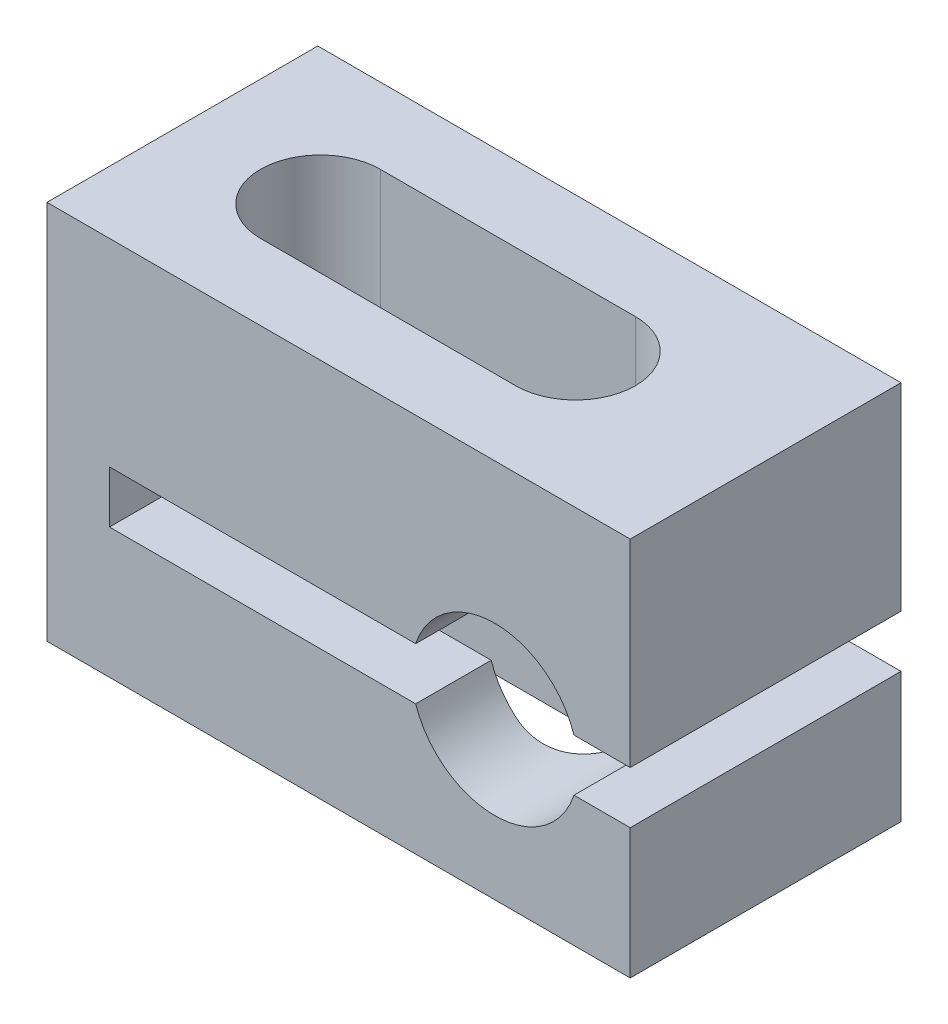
ISO-10303-21;
HEADER;
FILE_DESCRIPTION(('STEP AP214'),'2;1');
FILE_NAME('part.step','',(''),(''),'','','');
FILE_SCHEMA(('AUTOMOTIVE_DESIGN { 1 0 10303 214 1 1 1 1 }'));
ENDSEC;
DATA;
#1=APPLICATION_CONTEXT('core data for automotive mechanical design processes');
#2=APPLICATION_PROTOCOL_DEFINITION('international standard','automotive_design',2000,#1);
#3=PRODUCT_CONTEXT('',#1,'mechanical');
#4=PRODUCT('Part','Part','',(#3));
#5=PRODUCT_RELATED_PRODUCT_CATEGORY('part','',(#4));
#6=PRODUCT_DEFINITION_FORMATION('','',#4);
#7=PRODUCT_DEFINITION_CONTEXT('part definition',#1,'design');
#8=PRODUCT_DEFINITION('design','',#6,#7);
#9=PRODUCT_DEFINITION_SHAPE('','',#8);
#10=(LENGTH_UNIT() NAMED_UNIT(*) SI_UNIT(.MILLI.,.METRE.));
#11=(NAMED_UNIT(*) PLANE_ANGLE_UNIT() SI_UNIT($,.RADIAN.));
#12=(NAMED_UNIT(*) SI_UNIT($,.STERADIAN.) SOLID_ANGLE_UNIT());
#13=UNCERTAINTY_MEASURE_WITH_UNIT(LENGTH_MEASURE(1.E-05),#10,'distance_accuracy_value','');
#14=(GEOMETRIC_REPRESENTATION_CONTEXT(3) GLOBAL_UNCERTAINTY_ASSIGNED_CONTEXT((#13)) GLOBAL_UNIT_ASSIGNED_CONTEXT((#10,
#11,#12)) REPRESENTATION_CONTEXT('',''));
#15=CARTESIAN_POINT('',(0.,0.,0.));
#16=DIRECTION('',(0.,0.,1.));
#17=DIRECTION('',(1.,0.,0.));
#18=AXIS2_PLACEMENT_3D('',#15,#16,#17);
#19=CARTESIAN_POINT('',(17.6045,0.182500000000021,21.0241));
#20=DIRECTION('',(0.,0.,-1.));
#21=DIRECTION('',(-1.,0.,0.));
#22=AXIS2_PLACEMENT_3D('',#19,#20,#21);
#23=PLANE('',#22);
#24=CARTESIAN_POINT('',(18.938,-5.27850000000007,21.0241));
#25=DIRECTION('',(0.,0.,1.));
#26=DIRECTION('',(0.,-1.,0.));
#27=AXIS2_PLACEMENT_3D('',#24,#25,#26);
#28=CIRCLE('',#27,2.032);
#29=CARTESIAN_POINT('',(17.0077671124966,-4.64349999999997,21.0241));
#30=VERTEX_POINT('',#29);
#31=CARTESIAN_POINT('',(17.6045,-3.74526754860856,21.0241));
#32=VERTEX_POINT('',#31);
#33=EDGE_CURVE('E263',#30,#32,#28,.F.);
#34=ORIENTED_EDGE('',*,*,#33,.T.);
#35=DIRECTION('',(0.,-1.,0.));
#36=VECTOR('',#35,1.);
#37=CARTESIAN_POINT('',(17.6045,0.182500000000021,21.0241));
#38=LINE('',#37,#36);
#39=CARTESIAN_POINT('',(17.6045,0.182500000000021,21.0241));
#40=VERTEX_POINT('',#39);
#41=EDGE_CURVE('E153',#32,#40,#38,.F.);
#42=ORIENTED_EDGE('',*,*,#41,.T.);
#43=DIRECTION('',(1.,0.,0.));
#44=VECTOR('',#43,1.);
#45=CARTESIAN_POINT('',(8.01599999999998,0.182500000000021,21.0241));
#46=LINE('',#45,#44);
#47=CARTESIAN_POINT('',(11.3815,0.182500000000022,21.0241));
#48=VERTEX_POINT('',#47);
#49=EDGE_CURVE('E145',#48,#40,#46,.T.);
#50=ORIENTED_EDGE('',*,*,#49,.F.);
#51=DIRECTION('',(0.,-1.,0.));
#52=VECTOR('',#51,1.);
#53=CARTESIAN_POINT('',(11.3815,0.182500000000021,21.0241));
#54=LINE('',#53,#52);
#55=CARTESIAN_POINT('',(11.3815,-4.64349999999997,21.0241));
#56=VERTEX_POINT('',#55);
#57=EDGE_CURVE('E128',#48,#56,#54,.T.);
#58=ORIENTED_EDGE('',*,*,#57,.T.);
#59=DIRECTION('',(1.,0.,0.));
#60=VECTOR('',#59,1.);
#61=CARTESIAN_POINT('',(17.0077671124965,-4.64349999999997,21.0241));
#62=LINE('',#61,#60);
#63=EDGE_CURVE('E133',#30,#56,#62,.F.);
#64=ORIENTED_EDGE('',*,*,#63,.F.);
#65=EDGE_LOOP('',(#34,#42,#50,#58,#64));
#66=FACE_BOUND('',#65,.T.);
#67=ADVANCED_FACE('F15',(#66),#23,.F.);
#68=CARTESIAN_POINT('',(17.6045,0.182500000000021,22.4846));
#69=DIRECTION('',(0.,-1.,0.));
#70=DIRECTION('',(0.,0.,-1.));
#71=AXIS2_PLACEMENT_3D('',#68,#69,#70);
#72=CYLINDRICAL_SURFACE('',#71,1.4605);
#73=CARTESIAN_POINT('',(17.6045,-3.74526754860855,21.0241));
#74=CARTESIAN_POINT('',(17.6335546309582,-3.71999019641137,21.0240979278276));
#75=CARTESIAN_POINT('',(17.6633439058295,-3.69554014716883,21.0249673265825));
#76=CARTESIAN_POINT('',(17.7242057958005,-3.64840661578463,21.0286948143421));
#77=CARTESIAN_POINT('',(17.7552794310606,-3.62572458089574,21.0315545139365));
#78=CARTESIAN_POINT('',(17.8185576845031,-3.58222449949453,21.0395193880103));
#79=CARTESIAN_POINT('',(17.8507650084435,-3.56141140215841,21.044630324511));
#80=CARTESIAN_POINT('',(17.91592788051,-3.52184141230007,21.0573027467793));
#81=CARTESIAN_POINT('',(17.948883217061,-3.50308394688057,21.0648635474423));
#82=CARTESIAN_POINT('',(18.0487775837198,-3.44984217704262,21.0916086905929));
#83=CARTESIAN_POINT('',(18.1164526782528,-3.4185876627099,21.1148234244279));
#84=CARTESIAN_POINT('',(18.2502658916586,-3.36506296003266,21.1725994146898));
#85=CARTESIAN_POINT('',(18.3164072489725,-3.3427718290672,21.2071338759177));
#86=CARTESIAN_POINT('',(18.4389652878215,-3.30778263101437,21.2839602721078));
#87=CARTESIAN_POINT('',(18.4957364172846,-3.29445825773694,21.3254072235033));
#88=CARTESIAN_POINT('',(18.6033158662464,-3.27350072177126,21.416699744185));
#89=CARTESIAN_POINT('',(18.6541185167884,-3.26587293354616,21.466553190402));
#90=CARTESIAN_POINT('',(18.7493233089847,-3.25469465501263,21.5747801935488));
#91=CARTESIAN_POINT('',(18.7935228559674,-3.25125623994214,21.6333427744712));
#92=CARTESIAN_POINT('',(18.8726937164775,-3.24716187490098,21.7565131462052));
#93=CARTESIAN_POINT('',(18.9076598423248,-3.24650748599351,21.8211243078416));
#94=CARTESIAN_POINT('',(18.9700760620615,-3.24649196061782,21.9605870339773));
#95=CARTESIAN_POINT('',(18.996625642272,-3.24724641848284,22.0358416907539));
#96=CARTESIAN_POINT('',(19.0370894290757,-3.24881502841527,22.1895667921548));
#97=CARTESIAN_POINT('',(19.0510279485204,-3.24962906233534,22.2680307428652));
#98=CARTESIAN_POINT('',(19.0606691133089,-3.25020579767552,22.3698753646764));
#99=CARTESIAN_POINT('',(19.0622921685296,-3.25030454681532,22.3927879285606));
#100=CARTESIAN_POINT('',(19.0644580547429,-3.25043851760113,22.4386636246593));
#101=CARTESIAN_POINT('',(19.0650009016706,-3.25047374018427,22.4616267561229));
#102=CARTESIAN_POINT('',(19.0649967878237,-3.25046869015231,22.5664370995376));
#103=CARTESIAN_POINT('',(19.0580927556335,-3.25000368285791,22.6483912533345));
#104=CARTESIAN_POINT('',(19.0306341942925,-3.24856765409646,22.8101080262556));
#105=CARTESIAN_POINT('',(19.0100477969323,-3.2475954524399,22.8898650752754));
#106=CARTESIAN_POINT('',(18.9557905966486,-3.24639764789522,23.044779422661));
#107=CARTESIAN_POINT('',(18.9221263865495,-3.24617166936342,23.1199390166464));
#108=CARTESIAN_POINT('',(18.842687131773,-3.24834958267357,23.2634951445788));
#109=CARTESIAN_POINT('',(18.7969178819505,-3.25075221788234,23.3318948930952));
#110=CARTESIAN_POINT('',(18.6954767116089,-3.2603926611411,23.4589394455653));
#111=CARTESIAN_POINT('',(18.6399582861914,-3.2675597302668,23.5177115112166));
#112=CARTESIAN_POINT('',(18.5207568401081,-3.28888236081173,23.6247462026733));
#113=CARTESIAN_POINT('',(18.4570813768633,-3.30303148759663,23.6730184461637));
#114=CARTESIAN_POINT('',(18.3299128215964,-3.33858942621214,23.7542731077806));
#115=CARTESIAN_POINT('',(18.2668159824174,-3.3593237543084,23.7881722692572));
#116=CARTESIAN_POINT('',(18.1390766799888,-3.40889274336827,23.8455518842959));
#117=CARTESIAN_POINT('',(18.0744340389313,-3.43772834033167,23.8690311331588));
#118=CARTESIAN_POINT('',(17.9492668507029,-3.50193933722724,23.9052555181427));
#119=CARTESIAN_POINT('',(17.8886863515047,-3.53697060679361,23.9184280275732));
#120=CARTESIAN_POINT('',(17.7707477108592,-3.6137217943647,23.9368333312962));
#121=CARTESIAN_POINT('',(17.7133866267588,-3.65543546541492,23.9420734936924));
#122=CARTESIAN_POINT('',(17.6401325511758,-3.71481115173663,23.944779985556));
#123=CARTESIAN_POINT('',(17.6221761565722,-3.72988876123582,23.9451018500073));
#124=CARTESIAN_POINT('',(17.6045,-3.74526754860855,23.9451));
#125=B_SPLINE_CURVE_WITH_KNOTS('',3,(#73,#74,#75,#76,#77,#78,#79,#80,#81,#82,#83,#84,#85,#86,
#87,#88,#89,#90,#91,#92,#93,#94,#95,#96,#97,#98,#99,#100,#101,#102,#103,#104,#105,#106,#107,
#108,#109,#110,#111,#112,#113,#114,#115,#116,#117,#118,#119,#120,#121,#122,#123,#124),
.UNSPECIFIED.,.F.,.F.,(4,2,2,2,2,2,2,2,2,2,2,2,2,2,2,2,2,2,2,2,2,2,2,2,2,4),(0.,
0.115524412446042,0.23114241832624,0.347058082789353,0.462941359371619,0.695758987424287,
0.928029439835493,1.14165945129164,1.35549075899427,1.57492511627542,1.79448249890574,
2.03284914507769,2.27075525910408,2.33964860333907,2.40854093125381,2.65396781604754,
2.89996834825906,3.1458450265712,3.3916042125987,3.6337936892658,3.87576038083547,
4.09828962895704,4.32084459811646,4.53359358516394,4.7461448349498,4.81646215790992),.UNSPECIFIED.);
#126=CARTESIAN_POINT('',(17.6045,-3.74526754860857,23.9451));
#127=VERTEX_POINT('',#126);
#128=EDGE_CURVE('E279',#32,#127,#125,.T.);
#129=ORIENTED_EDGE('',*,*,#128,.T.);
#130=DIRECTION('',(0.,1.,0.));
#131=VECTOR('',#130,1.);
#132=CARTESIAN_POINT('',(17.6045,0.182500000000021,23.9451));
#133=LINE('',#132,#131);
#134=CARTESIAN_POINT('',(17.6045,0.182500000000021,23.9451));
#135=VERTEX_POINT('',#134);
#136=EDGE_CURVE('E147',#127,#135,#133,.T.);
#137=ORIENTED_EDGE('',*,*,#136,.T.);
#138=CARTESIAN_POINT('',(17.6045,0.182500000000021,22.4846));
#139=DIRECTION('',(0.,-1.,0.));
#140=DIRECTION('',(0.,0.,-1.));
#141=AXIS2_PLACEMENT_3D('',#138,#139,#140);
#142=CIRCLE('',#141,1.4605);
#143=EDGE_CURVE('E390',#40,#135,#142,.T.);
#144=ORIENTED_EDGE('',*,*,#143,.F.);
#145=ORIENTED_EDGE('',*,*,#41,.F.);
#146=EDGE_LOOP('',(#129,#137,#144,#145));
#147=FACE_BOUND('',#146,.T.);
#148=ADVANCED_FACE('F400',(#147),#72,.F.);
#149=CARTESIAN_POINT('',(11.3815,0.182500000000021,23.9451));
#150=DIRECTION('',(0.,0.,1.));
#151=DIRECTION('',(1.,0.,0.));
#152=AXIS2_PLACEMENT_3D('',#149,#150,#151);
#153=PLANE('',#152);
#154=DIRECTION('',(0.,-1.,0.));
#155=VECTOR('',#154,1.);
#156=CARTESIAN_POINT('',(11.3815,0.182500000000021,23.9451));
#157=LINE('',#156,#155);
#158=CARTESIAN_POINT('',(11.3815,-4.64349999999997,23.9450999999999));
#159=VERTEX_POINT('',#158);
#160=CARTESIAN_POINT('',(11.3815,0.182500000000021,23.9450999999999));
#161=VERTEX_POINT('',#160);
#162=EDGE_CURVE('E123',#159,#161,#157,.F.);
#163=ORIENTED_EDGE('',*,*,#162,.T.);
#164=DIRECTION('',(1.,0.,0.));
#165=VECTOR('',#164,1.);
#166=CARTESIAN_POINT('',(8.01599999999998,0.182500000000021,23.9450999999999));
#167=LINE('',#166,#165);
#168=EDGE_CURVE('E389',#135,#161,#167,.F.);
#169=ORIENTED_EDGE('',*,*,#168,.F.);
#170=ORIENTED_EDGE('',*,*,#136,.F.);
#171=CARTESIAN_POINT('',(18.938,-5.27850000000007,23.9451));
#172=DIRECTION('',(0.,0.,1.));
#173=DIRECTION('',(0.,-1.,0.));
#174=AXIS2_PLACEMENT_3D('',#171,#172,#173);
#175=CIRCLE('',#174,2.032);
#176=CARTESIAN_POINT('',(17.0077671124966,-4.64349999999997,23.9451));
#177=VERTEX_POINT('',#176);
#178=EDGE_CURVE('E308',#127,#177,#175,.T.);
#179=ORIENTED_EDGE('',*,*,#178,.T.);
#180=DIRECTION('',(1.,0.,0.));
#181=VECTOR('',#180,1.);
#182=CARTESIAN_POINT('',(17.0077671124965,-4.64349999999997,23.9450999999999));
#183=LINE('',#182,#181);
#184=EDGE_CURVE('E132',#159,#177,#183,.T.);
#185=ORIENTED_EDGE('',*,*,#184,.F.);
#186=EDGE_LOOP('',(#163,#169,#170,#179,#185));
#187=FACE_BOUND('',#186,.T.);
#188=ADVANCED_FACE('F569',(#187),#153,.F.);
#189=CARTESIAN_POINT('',(11.3815,0.182500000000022,22.4846));
#190=DIRECTION('',(0.,-1.,0.));
#191=DIRECTION('',(0.,0.,-1.));
#192=AXIS2_PLACEMENT_3D('',#189,#190,#191);
#193=CYLINDRICAL_SURFACE('',#192,1.4605);
#194=CARTESIAN_POINT('',(11.3815,-4.64349999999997,22.4846));
#195=DIRECTION('',(0.,-1.,0.));
#196=DIRECTION('',(0.,0.,-1.));
#197=AXIS2_PLACEMENT_3D('',#194,#195,#196);
#198=CIRCLE('',#197,1.4605);
#199=EDGE_CURVE('E20',#56,#159,#198,.F.);
#200=ORIENTED_EDGE('',*,*,#199,.F.);
#201=ORIENTED_EDGE('',*,*,#57,.F.);
#202=CARTESIAN_POINT('',(11.3815,0.182500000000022,22.4846));
#203=DIRECTION('',(0.,-1.,0.));
#204=DIRECTION('',(0.,0.,-1.));
#205=AXIS2_PLACEMENT_3D('',#202,#203,#204);
#206=CIRCLE('',#205,1.4605);
#207=EDGE_CURVE('E293',#161,#48,#206,.T.);
#208=ORIENTED_EDGE('',*,*,#207,.F.);
#209=ORIENTED_EDGE('',*,*,#162,.F.);
#210=EDGE_LOOP('',(#200,#201,#208,#209));
#211=FACE_BOUND('',#210,.T.);
#212=ADVANCED_FACE('F126',(#211),#193,.F.);
#213=CARTESIAN_POINT('',(9.53999999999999,-4.64349999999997,19.1826));
#214=DIRECTION('',(1.,0.,0.));
#215=DIRECTION('',(0.,0.,-1.));
#216=AXIS2_PLACEMENT_3D('',#213,#214,#215);
#217=PLANE('',#216);
#218=DIRECTION('',(0.,1.,0.));
#219=VECTOR('',#218,1.);
#220=CARTESIAN_POINT('',(9.53999999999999,-4.76028261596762,19.1826));
#221=LINE('',#220,#219);
#222=CARTESIAN_POINT('',(9.53999999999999,-5.91349999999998,19.1826));
#223=VERTEX_POINT('',#222);
#224=CARTESIAN_POINT('',(9.53999999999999,-4.64349999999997,19.1826));
#225=VERTEX_POINT('',#224);
#226=EDGE_CURVE('E282',#223,#225,#221,.T.);
#227=ORIENTED_EDGE('',*,*,#226,.T.);
#228=DIRECTION('',(0.,0.,-1.));
#229=VECTOR('',#228,1.);
#230=CARTESIAN_POINT('',(9.53999999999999,-4.64349999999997,19.1826));
#231=LINE('',#230,#229);
#232=CARTESIAN_POINT('',(9.53999999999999,-4.64349999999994,25.7866));
#233=VERTEX_POINT('',#232);
#234=EDGE_CURVE('E276',#233,#225,#231,.T.);
#235=ORIENTED_EDGE('',*,*,#234,.F.);
#236=DIRECTION('',(0.,1.,0.));
#237=VECTOR('',#236,1.);
#238=CARTESIAN_POINT('',(9.53999999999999,-4.76028261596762,25.7866));
#239=LINE('',#238,#237);
#240=CARTESIAN_POINT('',(9.53999999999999,-5.91349999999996,25.7866));
#241=VERTEX_POINT('',#240);
#242=EDGE_CURVE('E309',#241,#233,#239,.T.);
#243=ORIENTED_EDGE('',*,*,#242,.F.);
#244=DIRECTION('',(0.,0.,1.));
#245=VECTOR('',#244,1.);
#246=CARTESIAN_POINT('',(9.53999999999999,-5.91349999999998,19.1826));
#247=LINE('',#246,#245);
#248=EDGE_CURVE('E289',#223,#241,#247,.T.);
#249=ORIENTED_EDGE('',*,*,#248,.F.);
#250=EDGE_LOOP('',(#227,#235,#243,#249));
#251=FACE_BOUND('',#250,.T.);
#252=ADVANCED_FACE('F568',(#251),#217,.T.);
#253=CARTESIAN_POINT('',(17.0077671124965,-4.64349999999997,19.1826));
#254=DIRECTION('',(0.,-1.,0.));
#255=DIRECTION('',(0.,0.,-1.));
#256=AXIS2_PLACEMENT_3D('',#253,#254,#255);
#257=PLANE('',#256);
#258=DIRECTION('',(1.,0.,0.));
#259=VECTOR('',#258,1.);
#260=CARTESIAN_POINT('',(15.2964724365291,-4.64349999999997,19.1826));
#261=LINE('',#260,#259);
#262=CARTESIAN_POINT('',(17.0077671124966,-4.64349999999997,19.1826));
#263=VERTEX_POINT('',#262);
#264=EDGE_CURVE('E285',#225,#263,#261,.T.);
#265=ORIENTED_EDGE('',*,*,#264,.T.);
#266=DIRECTION('',(0.,0.,1.));
#267=VECTOR('',#266,1.);
#268=CARTESIAN_POINT('',(17.0077671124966,-4.64349999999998,19.1826));
#269=LINE('',#268,#267);
#270=EDGE_CURVE('E137',#263,#30,#269,.T.);
#271=ORIENTED_EDGE('',*,*,#270,.T.);
#272=ORIENTED_EDGE('',*,*,#63,.T.);
#273=ORIENTED_EDGE('',*,*,#199,.T.);
#274=ORIENTED_EDGE('',*,*,#184,.T.);
#275=DIRECTION('',(0.,0.,1.));
#276=VECTOR('',#275,1.);
#277=CARTESIAN_POINT('',(17.0077671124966,-4.64349999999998,19.1826));
#278=LINE('',#277,#276);
#279=CARTESIAN_POINT('',(17.0077671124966,-4.64349999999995,25.7866));
#280=VERTEX_POINT('',#279);
#281=EDGE_CURVE('E275',#177,#280,#278,.T.);
#282=ORIENTED_EDGE('',*,*,#281,.T.);
#283=DIRECTION('',(1.,0.,0.));
#284=VECTOR('',#283,1.);
#285=CARTESIAN_POINT('',(15.2964724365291,-4.64349999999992,25.7866));
#286=LINE('',#285,#284);
#287=EDGE_CURVE('E312',#233,#280,#286,.T.);
#288=ORIENTED_EDGE('',*,*,#287,.F.);
#289=ORIENTED_EDGE('',*,*,#234,.T.);
#290=EDGE_LOOP('',(#265,#271,#272,#273,#274,#282,#288,#289));
#291=FACE_BOUND('',#290,.T.);
#292=ADVANCED_FACE('F136',(#291),#257,.T.);
#293=CARTESIAN_POINT('',(18.938,-5.27850000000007,19.1826));
#294=DIRECTION('',(0.,0.,1.));
#295=DIRECTION('',(0.,-1.,0.));
#296=AXIS2_PLACEMENT_3D('',#293,#294,#295);
#297=CYLINDRICAL_SURFACE('',#296,2.032);
#298=ORIENTED_EDGE('',*,*,#270,.F.);
#299=CARTESIAN_POINT('',(18.938,-5.27850000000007,19.1826));
#300=DIRECTION('',(0.,0.,1.));
#301=DIRECTION('',(0.,-1.,0.));
#302=AXIS2_PLACEMENT_3D('',#299,#300,#301);
#303=CIRCLE('',#302,2.032);
#304=CARTESIAN_POINT('',(20.8682328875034,-4.64349999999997,19.1826));
#305=VERTEX_POINT('',#304);
#306=EDGE_CURVE('E348',#263,#305,#303,.F.);
#307=ORIENTED_EDGE('',*,*,#306,.T.);
#308=DIRECTION('',(0.,0.,-1.));
#309=VECTOR('',#308,1.);
#310=CARTESIAN_POINT('',(20.8682328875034,-4.64349999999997,19.1826));
#311=LINE('',#310,#309);
#312=CARTESIAN_POINT('',(20.8682328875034,-4.64349999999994,25.7866));
#313=VERTEX_POINT('',#312);
#314=EDGE_CURVE('E260',#313,#305,#311,.T.);
#315=ORIENTED_EDGE('',*,*,#314,.F.);
#316=CARTESIAN_POINT('',(18.938,-5.27850000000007,25.7866));
#317=DIRECTION('',(0.,0.,1.));
#318=DIRECTION('',(0.,-1.,0.));
#319=AXIS2_PLACEMENT_3D('',#316,#317,#318);
#320=CIRCLE('',#319,2.032);
#321=EDGE_CURVE('E386',#280,#313,#320,.F.);
#322=ORIENTED_EDGE('',*,*,#321,.F.);
#323=ORIENTED_EDGE('',*,*,#281,.F.);
#324=ORIENTED_EDGE('',*,*,#178,.F.);
#325=ORIENTED_EDGE('',*,*,#128,.F.);
#326=ORIENTED_EDGE('',*,*,#33,.F.);
#327=EDGE_LOOP('',(#298,#307,#315,#322,#323,#324,#325,#326));
#328=FACE_BOUND('',#327,.T.);
#329=ADVANCED_FACE('F404',(#328),#297,.F.);
#330=CARTESIAN_POINT('',(22.24,-4.64349999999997,19.1826));
#331=DIRECTION('',(0.,-1.,0.));
#332=DIRECTION('',(0.,0.,-1.));
#333=AXIS2_PLACEMENT_3D('',#330,#331,#332);
#334=PLANE('',#333);
#335=DIRECTION('',(1.,0.,0.));
#336=VECTOR('',#335,1.);
#337=CARTESIAN_POINT('',(15.2964724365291,-4.64349999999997,19.1826));
#338=LINE('',#337,#336);
#339=CARTESIAN_POINT('',(22.24,-4.64349999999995,19.1826));
#340=VERTEX_POINT('',#339);
#341=EDGE_CURVE('E266',#305,#340,#338,.T.);
#342=ORIENTED_EDGE('',*,*,#341,.T.);
#343=DIRECTION('',(0.,0.,-1.));
#344=VECTOR('',#343,1.);
#345=CARTESIAN_POINT('',(22.24,-4.64349999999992,19.1826));
#346=LINE('',#345,#344);
#347=CARTESIAN_POINT('',(22.24,-4.64349999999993,25.7866));
#348=VERTEX_POINT('',#347);
#349=EDGE_CURVE('E262',#348,#340,#346,.T.);
#350=ORIENTED_EDGE('',*,*,#349,.F.);
#351=DIRECTION('',(1.,0.,0.));
#352=VECTOR('',#351,1.);
#353=CARTESIAN_POINT('',(15.2964724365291,-4.64349999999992,25.7866));
#354=LINE('',#353,#352);
#355=EDGE_CURVE('E345',#313,#348,#354,.T.);
#356=ORIENTED_EDGE('',*,*,#355,.F.);
#357=ORIENTED_EDGE('',*,*,#314,.T.);
#358=EDGE_LOOP('',(#342,#350,#356,#357));
#359=FACE_BOUND('',#358,.T.);
#360=ADVANCED_FACE('F409',(#359),#334,.T.);
#361=CARTESIAN_POINT('',(22.24,0.182500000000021,19.1826));
#362=DIRECTION('',(1.,0.,0.));
#363=DIRECTION('',(0.,0.,-1.));
#364=AXIS2_PLACEMENT_3D('',#361,#362,#363);
#365=PLANE('',#364);
#366=DIRECTION('',(0.,1.,0.));
#367=VECTOR('',#366,1.);
#368=CARTESIAN_POINT('',(22.24,-4.76028261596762,19.1826));
#369=LINE('',#368,#367);
#370=CARTESIAN_POINT('',(22.24,0.182500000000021,19.1826));
#371=VERTEX_POINT('',#370);
#372=EDGE_CURVE('E159',#340,#371,#369,.T.);
#373=ORIENTED_EDGE('',*,*,#372,.T.);
#374=DIRECTION('',(0.,0.,1.));
#375=VECTOR('',#374,1.);
#376=CARTESIAN_POINT('',(22.24,0.182500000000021,19.1826));
#377=LINE('',#376,#375);
#378=CARTESIAN_POINT('',(22.24,0.182500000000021,25.7866));
#379=VERTEX_POINT('',#378);
#380=EDGE_CURVE('E271',#379,#371,#377,.F.);
#381=ORIENTED_EDGE('',*,*,#380,.F.);
#382=DIRECTION('',(0.,1.,0.));
#383=VECTOR('',#382,1.);
#384=CARTESIAN_POINT('',(22.24,-4.76028261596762,25.7866));
#385=LINE('',#384,#383);
#386=EDGE_CURVE('E292',#348,#379,#385,.T.);
#387=ORIENTED_EDGE('',*,*,#386,.F.);
#388=ORIENTED_EDGE('',*,*,#349,.T.);
#389=EDGE_LOOP('',(#373,#381,#387,#388));
#390=FACE_BOUND('',#389,.T.);
#391=ADVANCED_FACE('F414',(#390),#365,.T.);
#392=CARTESIAN_POINT('',(8.01599999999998,0.182500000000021,19.1826));
#393=DIRECTION('',(0.,1.,0.));
#394=DIRECTION('',(0.,0.,1.));
#395=AXIS2_PLACEMENT_3D('',#392,#393,#394);
#396=PLANE('',#395);
#397=ORIENTED_EDGE('',*,*,#168,.T.);
#398=ORIENTED_EDGE('',*,*,#207,.T.);
#399=ORIENTED_EDGE('',*,*,#49,.T.);
#400=ORIENTED_EDGE('',*,*,#143,.T.);
#401=EDGE_LOOP('',(#397,#398,#399,#400));
#402=FACE_BOUND('',#401,.T.);
#403=DIRECTION('',(1.,0.,0.));
#404=VECTOR('',#403,1.);
#405=CARTESIAN_POINT('',(15.2964724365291,0.182500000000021,19.1826));
#406=LINE('',#405,#404);
#407=CARTESIAN_POINT('',(8.01599999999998,0.182500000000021,19.1826));
#408=VERTEX_POINT('',#407);
#409=EDGE_CURVE('E155',#371,#408,#406,.F.);
#410=ORIENTED_EDGE('',*,*,#409,.T.);
#411=DIRECTION('',(0.,0.,1.));
#412=VECTOR('',#411,1.);
#413=CARTESIAN_POINT('',(8.01599999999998,0.182500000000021,19.1826));
#414=LINE('',#413,#412);
#415=CARTESIAN_POINT('',(8.01599999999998,0.182500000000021,25.7866));
#416=VERTEX_POINT('',#415);
#417=EDGE_CURVE('E339',#416,#408,#414,.F.);
#418=ORIENTED_EDGE('',*,*,#417,.F.);
#419=DIRECTION('',(1.,0.,0.));
#420=VECTOR('',#419,1.);
#421=CARTESIAN_POINT('',(15.2964724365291,0.182500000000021,25.7866));
#422=LINE('',#421,#420);
#423=EDGE_CURVE('E303',#379,#416,#422,.F.);
#424=ORIENTED_EDGE('',*,*,#423,.F.);
#425=ORIENTED_EDGE('',*,*,#380,.T.);
#426=EDGE_LOOP('',(#410,#418,#424,#425));
#427=FACE_BOUND('',#426,.T.);
#428=ADVANCED_FACE('F418',(#402,#427),#396,.T.);
#429=CARTESIAN_POINT('',(20.8682328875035,-5.91349999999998,19.1826));
#430=DIRECTION('',(0.,1.,0.));
#431=DIRECTION('',(0.,0.,1.));
#432=AXIS2_PLACEMENT_3D('',#429,#430,#431);
#433=PLANE('',#432);
#434=DIRECTION('',(1.,0.,0.));
#435=VECTOR('',#434,1.);
#436=CARTESIAN_POINT('',(15.2964724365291,-5.91349999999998,19.1826));
#437=LINE('',#436,#435);
#438=CARTESIAN_POINT('',(22.24,-5.91349999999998,19.1826));
#439=VERTEX_POINT('',#438);
#440=CARTESIAN_POINT('',(20.8682328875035,-5.91349999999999,19.1826));
#441=VERTEX_POINT('',#440);
#442=EDGE_CURVE('E217',#439,#441,#437,.F.);
#443=ORIENTED_EDGE('',*,*,#442,.T.);
#444=DIRECTION('',(0.,0.,1.));
#445=VECTOR('',#444,1.);
#446=CARTESIAN_POINT('',(20.8682328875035,-5.9135,19.1826));
#447=LINE('',#446,#445);
#448=CARTESIAN_POINT('',(20.8682328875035,-5.91349999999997,25.7865999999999));
#449=VERTEX_POINT('',#448);
#450=EDGE_CURVE('E252',#441,#449,#447,.T.);
#451=ORIENTED_EDGE('',*,*,#450,.T.);
#452=DIRECTION('',(1.,0.,0.));
#453=VECTOR('',#452,1.);
#454=CARTESIAN_POINT('',(15.2964724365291,-5.91349999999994,25.7866));
#455=LINE('',#454,#453);
#456=CARTESIAN_POINT('',(22.24,-5.91349999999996,25.7866));
#457=VERTEX_POINT('',#456);
#458=EDGE_CURVE('E323',#457,#449,#455,.F.);
#459=ORIENTED_EDGE('',*,*,#458,.F.);
#460=DIRECTION('',(0.,0.,-1.));
#461=VECTOR('',#460,1.);
#462=CARTESIAN_POINT('',(22.24,-5.91349999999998,19.1826));
#463=LINE('',#462,#461);
#464=EDGE_CURVE('E221',#439,#457,#463,.F.);
#465=ORIENTED_EDGE('',*,*,#464,.F.);
#466=EDGE_LOOP('',(#443,#451,#459,#465));
#467=FACE_BOUND('',#466,.T.);
#468=ADVANCED_FACE('F422',(#467),#433,.T.);
#469=CARTESIAN_POINT('',(9.53999999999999,-5.91349999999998,19.1826));
#470=DIRECTION('',(0.,1.,0.));
#471=DIRECTION('',(0.,0.,1.));
#472=AXIS2_PLACEMENT_3D('',#469,#470,#471);
#473=PLANE('',#472);
#474=DIRECTION('',(1.,0.,0.));
#475=VECTOR('',#474,1.);
#476=CARTESIAN_POINT('',(15.2964724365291,-5.91349999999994,25.7866));
#477=LINE('',#476,#475);
#478=CARTESIAN_POINT('',(17.0077671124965,-5.91349999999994,25.7866));
#479=VERTEX_POINT('',#478);
#480=EDGE_CURVE('E313',#479,#241,#477,.F.);
#481=ORIENTED_EDGE('',*,*,#480,.F.);
#482=DIRECTION('',(0.,0.,1.));
#483=VECTOR('',#482,1.);
#484=CARTESIAN_POINT('',(17.0077671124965,-5.91349999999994,19.1826));
#485=LINE('',#484,#483);
#486=CARTESIAN_POINT('',(17.0077671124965,-5.91349999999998,23.9451));
#487=VERTEX_POINT('',#486);
#488=EDGE_CURVE('E248',#479,#487,#485,.F.);
#489=ORIENTED_EDGE('',*,*,#488,.T.);
#490=DIRECTION('',(1.,0.,0.));
#491=VECTOR('',#490,1.);
#492=CARTESIAN_POINT('',(11.3815,-5.91349999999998,23.9451));
#493=LINE('',#492,#491);
#494=CARTESIAN_POINT('',(11.3815,-5.91349999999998,23.9451));
#495=VERTEX_POINT('',#494);
#496=EDGE_CURVE('E242',#487,#495,#493,.F.);
#497=ORIENTED_EDGE('',*,*,#496,.T.);
#498=CARTESIAN_POINT('',(11.3815,-5.91349999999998,22.4846));
#499=DIRECTION('',(0.,-1.,0.));
#500=DIRECTION('',(0.,0.,-1.));
#501=AXIS2_PLACEMENT_3D('',#498,#499,#500);
#502=CIRCLE('',#501,1.4605);
#503=CARTESIAN_POINT('',(11.3815,-5.91349999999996,21.0241));
#504=VERTEX_POINT('',#503);
#505=EDGE_CURVE('E247',#495,#504,#502,.T.);
#506=ORIENTED_EDGE('',*,*,#505,.T.);
#507=DIRECTION('',(-1.,0.,0.));
#508=VECTOR('',#507,1.);
#509=CARTESIAN_POINT('',(17.6045,-5.91349999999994,21.0241));
#510=LINE('',#509,#508);
#511=CARTESIAN_POINT('',(17.0077671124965,-5.91349999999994,21.0241));
#512=VERTEX_POINT('',#511);
#513=EDGE_CURVE('E246',#504,#512,#510,.F.);
#514=ORIENTED_EDGE('',*,*,#513,.T.);
#515=DIRECTION('',(0.,0.,1.));
#516=VECTOR('',#515,1.);
#517=CARTESIAN_POINT('',(17.0077671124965,-5.91349999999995,19.1826));
#518=LINE('',#517,#516);
#519=CARTESIAN_POINT('',(17.0077671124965,-5.91349999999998,19.1826));
#520=VERTEX_POINT('',#519);
#521=EDGE_CURVE('E256',#512,#520,#518,.F.);
#522=ORIENTED_EDGE('',*,*,#521,.T.);
#523=DIRECTION('',(1.,0.,0.));
#524=VECTOR('',#523,1.);
#525=CARTESIAN_POINT('',(15.2964724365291,-5.91349999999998,19.1826));
#526=LINE('',#525,#524);
#527=EDGE_CURVE('E286',#520,#223,#526,.F.);
#528=ORIENTED_EDGE('',*,*,#527,.T.);
#529=ORIENTED_EDGE('',*,*,#248,.T.);
#530=EDGE_LOOP('',(#481,#489,#497,#506,#514,#522,#528,#529));
#531=FACE_BOUND('',#530,.T.);
#532=ADVANCED_FACE('F380',(#531),#473,.T.);
#533=CARTESIAN_POINT('',(15.2964724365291,-4.76028261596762,25.7866));
#534=DIRECTION('',(0.,0.,1.));
#535=DIRECTION('',(1.,0.,0.));
#536=AXIS2_PLACEMENT_3D('',#533,#534,#535);
#537=PLANE('',#536);
#538=ORIENTED_EDGE('',*,*,#321,.T.);
#539=ORIENTED_EDGE('',*,*,#355,.T.);
#540=ORIENTED_EDGE('',*,*,#386,.T.);
#541=ORIENTED_EDGE('',*,*,#423,.T.);
#542=DIRECTION('',(0.,1.,0.));
#543=VECTOR('',#542,1.);
#544=CARTESIAN_POINT('',(8.01599999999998,-9.08850000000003,25.7865999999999));
#545=LINE('',#544,#543);
#546=CARTESIAN_POINT('',(8.01599999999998,-9.08850000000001,25.7866));
#547=VERTEX_POINT('',#546);
#548=EDGE_CURVE('E343',#547,#416,#545,.T.);
#549=ORIENTED_EDGE('',*,*,#548,.F.);
#550=DIRECTION('',(1.,0.,0.));
#551=VECTOR('',#550,1.);
#552=CARTESIAN_POINT('',(22.24,-9.08850000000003,25.7865999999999));
#553=LINE('',#552,#551);
#554=CARTESIAN_POINT('',(22.24,-9.0885,25.7866));
#555=VERTEX_POINT('',#554);
#556=EDGE_CURVE('E232',#555,#547,#553,.F.);
#557=ORIENTED_EDGE('',*,*,#556,.F.);
#558=DIRECTION('',(0.,1.,0.));
#559=VECTOR('',#558,1.);
#560=CARTESIAN_POINT('',(22.24,-5.91349999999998,25.7865999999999));
#561=LINE('',#560,#559);
#562=EDGE_CURVE('E158',#457,#555,#561,.F.);
#563=ORIENTED_EDGE('',*,*,#562,.F.);
#564=ORIENTED_EDGE('',*,*,#458,.T.);
#565=CARTESIAN_POINT('',(18.938,-5.27850000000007,25.7865999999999));
#566=DIRECTION('',(0.,0.,1.));
#567=DIRECTION('',(0.,-1.,0.));
#568=AXIS2_PLACEMENT_3D('',#565,#566,#567);
#569=CIRCLE('',#568,2.032);
#570=EDGE_CURVE('E251',#449,#479,#569,.F.);
#571=ORIENTED_EDGE('',*,*,#570,.T.);
#572=ORIENTED_EDGE('',*,*,#480,.T.);
#573=ORIENTED_EDGE('',*,*,#242,.T.);
#574=ORIENTED_EDGE('',*,*,#287,.T.);
#575=EDGE_LOOP('',(#538,#539,#540,#541,#549,#557,#563,#564,#571,#572,#573,#574));
#576=FACE_BOUND('',#575,.T.);
#577=ADVANCED_FACE('F429',(#576),#537,.T.);
#578=CARTESIAN_POINT('',(8.01599999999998,-9.08850000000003,19.1826));
#579=DIRECTION('',(-1.,0.,0.));
#580=DIRECTION('',(0.,0.,1.));
#581=AXIS2_PLACEMENT_3D('',#578,#579,#580);
#582=PLANE('',#581);
#583=DIRECTION('',(0.,1.,0.));
#584=VECTOR('',#583,1.);
#585=CARTESIAN_POINT('',(8.01599999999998,-4.76028261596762,19.1826));
#586=LINE('',#585,#584);
#587=CARTESIAN_POINT('',(8.01599999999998,-9.08850000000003,19.1826));
#588=VERTEX_POINT('',#587);
#589=EDGE_CURVE('E342',#408,#588,#586,.F.);
#590=ORIENTED_EDGE('',*,*,#589,.T.);
#591=DIRECTION('',(0.,0.,-1.));
#592=VECTOR('',#591,1.);
#593=CARTESIAN_POINT('',(8.01599999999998,-9.08850000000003,19.1826));
#594=LINE('',#593,#592);
#595=EDGE_CURVE('E205',#547,#588,#594,.T.);
#596=ORIENTED_EDGE('',*,*,#595,.F.);
#597=ORIENTED_EDGE('',*,*,#548,.T.);
#598=ORIENTED_EDGE('',*,*,#417,.T.);
#599=EDGE_LOOP('',(#590,#596,#597,#598));
#600=FACE_BOUND('',#599,.T.);
#601=ADVANCED_FACE('F432',(#600),#582,.T.);
#602=CARTESIAN_POINT('',(15.2964724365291,-4.76028261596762,19.1826));
#603=DIRECTION('',(0.,0.,1.));
#604=DIRECTION('',(1.,0.,0.));
#605=AXIS2_PLACEMENT_3D('',#602,#603,#604);
#606=PLANE('',#605);
#607=ORIENTED_EDGE('',*,*,#372,.F.);
#608=ORIENTED_EDGE('',*,*,#341,.F.);
#609=ORIENTED_EDGE('',*,*,#306,.F.);
#610=ORIENTED_EDGE('',*,*,#264,.F.);
#611=ORIENTED_EDGE('',*,*,#226,.F.);
#612=ORIENTED_EDGE('',*,*,#527,.F.);
#613=CARTESIAN_POINT('',(18.938,-5.27850000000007,19.1826));
#614=DIRECTION('',(0.,0.,1.));
#615=DIRECTION('',(0.,-1.,0.));
#616=AXIS2_PLACEMENT_3D('',#613,#614,#615);
#617=CIRCLE('',#616,2.032);
#618=EDGE_CURVE('E255',#520,#441,#617,.T.);
#619=ORIENTED_EDGE('',*,*,#618,.T.);
#620=ORIENTED_EDGE('',*,*,#442,.F.);
#621=DIRECTION('',(0.,1.,0.));
#622=VECTOR('',#621,1.);
#623=CARTESIAN_POINT('',(22.24,-5.91349999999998,19.1826));
#624=LINE('',#623,#622);
#625=CARTESIAN_POINT('',(22.24,-9.08850000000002,19.1826));
#626=VERTEX_POINT('',#625);
#627=EDGE_CURVE('E213',#626,#439,#624,.T.);
#628=ORIENTED_EDGE('',*,*,#627,.F.);
#629=DIRECTION('',(1.,0.,0.));
#630=VECTOR('',#629,1.);
#631=CARTESIAN_POINT('',(22.24,-9.08850000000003,19.1826));
#632=LINE('',#631,#630);
#633=EDGE_CURVE('E197',#588,#626,#632,.T.);
#634=ORIENTED_EDGE('',*,*,#633,.F.);
#635=ORIENTED_EDGE('',*,*,#589,.F.);
#636=ORIENTED_EDGE('',*,*,#409,.F.);
#637=EDGE_LOOP('',(#607,#608,#609,#610,#611,#612,#619,#620,#628,#634,#635,#636));
#638=FACE_BOUND('',#637,.T.);
#639=ADVANCED_FACE('F215',(#638),#606,.F.);
#640=CARTESIAN_POINT('',(22.24,-5.91349999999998,19.1826));
#641=DIRECTION('',(1.,0.,0.));
#642=DIRECTION('',(0.,0.,-1.));
#643=AXIS2_PLACEMENT_3D('',#640,#641,#642);
#644=PLANE('',#643);
#645=ORIENTED_EDGE('',*,*,#627,.T.);
#646=ORIENTED_EDGE('',*,*,#464,.T.);
#647=ORIENTED_EDGE('',*,*,#562,.T.);
#648=DIRECTION('',(0.,0.,-1.));
#649=VECTOR('',#648,1.);
#650=CARTESIAN_POINT('',(22.24,-9.08850000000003,19.1826));
#651=LINE('',#650,#649);
#652=EDGE_CURVE('E201',#626,#555,#651,.F.);
#653=ORIENTED_EDGE('',*,*,#652,.F.);
#654=EDGE_LOOP('',(#645,#646,#647,#653));
#655=FACE_BOUND('',#654,.T.);
#656=ADVANCED_FACE('F224',(#655),#644,.T.);
#657=CARTESIAN_POINT('',(11.3815,-5.91349999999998,22.4846));
#658=DIRECTION('',(0.,-1.,0.));
#659=DIRECTION('',(0.,0.,-1.));
#660=AXIS2_PLACEMENT_3D('',#657,#658,#659);
#661=CYLINDRICAL_SURFACE('',#660,1.4605);
#662=ORIENTED_EDGE('',*,*,#505,.F.);
#663=DIRECTION('',(0.,1.,0.));
#664=VECTOR('',#663,1.);
#665=CARTESIAN_POINT('',(11.3815,0.182500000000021,23.9451));
#666=LINE('',#665,#664);
#667=CARTESIAN_POINT('',(11.3815,-9.08850000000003,23.9451));
#668=VERTEX_POINT('',#667);
#669=EDGE_CURVE('E239',#495,#668,#666,.F.);
#670=ORIENTED_EDGE('',*,*,#669,.T.);
#671=CARTESIAN_POINT('',(11.3815,-9.08850000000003,22.4846));
#672=DIRECTION('',(0.,-1.,0.));
#673=DIRECTION('',(0.,0.,-1.));
#674=AXIS2_PLACEMENT_3D('',#671,#672,#673);
#675=CIRCLE('',#674,1.4605);
#676=CARTESIAN_POINT('',(11.3815,-9.08849999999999,21.0241));
#677=VERTEX_POINT('',#676);
#678=EDGE_CURVE('E170',#677,#668,#675,.F.);
#679=ORIENTED_EDGE('',*,*,#678,.F.);
#680=DIRECTION('',(0.,1.,0.));
#681=VECTOR('',#680,1.);
#682=CARTESIAN_POINT('',(11.3815,0.182500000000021,21.0241));
#683=LINE('',#682,#681);
#684=EDGE_CURVE('E243',#677,#504,#683,.T.);
#685=ORIENTED_EDGE('',*,*,#684,.T.);
#686=EDGE_LOOP('',(#662,#670,#679,#685));
#687=FACE_BOUND('',#686,.T.);
#688=ADVANCED_FACE('F367',(#687),#661,.F.);
#689=CARTESIAN_POINT('',(17.6045,0.182500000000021,21.0241));
#690=DIRECTION('',(0.,0.,-1.));
#691=DIRECTION('',(-1.,0.,0.));
#692=AXIS2_PLACEMENT_3D('',#689,#690,#691);
#693=PLANE('',#692);
#694=ORIENTED_EDGE('',*,*,#513,.F.);
#695=ORIENTED_EDGE('',*,*,#684,.F.);
#696=DIRECTION('',(1.,0.,0.));
#697=VECTOR('',#696,1.);
#698=CARTESIAN_POINT('',(22.24,-9.08850000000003,21.0241));
#699=LINE('',#698,#697);
#700=CARTESIAN_POINT('',(17.6045,-9.08850000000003,21.0241));
#701=VERTEX_POINT('',#700);
#702=EDGE_CURVE('E226',#701,#677,#699,.F.);
#703=ORIENTED_EDGE('',*,*,#702,.F.);
#704=DIRECTION('',(0.,-1.,0.));
#705=VECTOR('',#704,1.);
#706=CARTESIAN_POINT('',(17.6045,0.182500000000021,21.0241));
#707=LINE('',#706,#705);
#708=CARTESIAN_POINT('',(17.6045,-6.81173245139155,21.0241));
#709=VERTEX_POINT('',#708);
#710=EDGE_CURVE('E169',#701,#709,#707,.F.);
#711=ORIENTED_EDGE('',*,*,#710,.T.);
#712=CARTESIAN_POINT('',(18.938,-5.27850000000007,21.0241));
#713=DIRECTION('',(0.,0.,1.));
#714=DIRECTION('',(0.,-1.,0.));
#715=AXIS2_PLACEMENT_3D('',#712,#713,#714);
#716=CIRCLE('',#715,2.032);
#717=EDGE_CURVE('E259',#709,#512,#716,.F.);
#718=ORIENTED_EDGE('',*,*,#717,.T.);
#719=EDGE_LOOP('',(#694,#695,#703,#711,#718));
#720=FACE_BOUND('',#719,.T.);
#721=ADVANCED_FACE('F178',(#720),#693,.F.);
#722=CARTESIAN_POINT('',(18.938,-5.27850000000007,19.1826));
#723=DIRECTION('',(0.,0.,1.));
#724=DIRECTION('',(0.,-1.,0.));
#725=AXIS2_PLACEMENT_3D('',#722,#723,#724);
#726=CYLINDRICAL_SURFACE('',#725,2.032);
#727=ORIENTED_EDGE('',*,*,#488,.F.);
#728=ORIENTED_EDGE('',*,*,#570,.F.);
#729=ORIENTED_EDGE('',*,*,#450,.F.);
#730=ORIENTED_EDGE('',*,*,#618,.F.);
#731=ORIENTED_EDGE('',*,*,#521,.F.);
#732=ORIENTED_EDGE('',*,*,#717,.F.);
#733=CARTESIAN_POINT('',(17.6045,-6.81173245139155,21.0241));
#734=CARTESIAN_POINT('',(17.6335546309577,-6.83700980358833,21.0240979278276));
#735=CARTESIAN_POINT('',(17.6633439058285,-6.86145985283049,21.0249673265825));
#736=CARTESIAN_POINT('',(17.7242057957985,-6.90859338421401,21.028694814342));
#737=CARTESIAN_POINT('',(17.7552794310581,-6.93127541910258,21.0315545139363));
#738=CARTESIAN_POINT('',(17.8185576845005,-6.97477550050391,21.0395193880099));
#739=CARTESIAN_POINT('',(17.8507650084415,-6.99558859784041,21.0446303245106));
#740=CARTESIAN_POINT('',(17.9159278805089,-7.03515858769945,21.057302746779));
#741=CARTESIAN_POINT('',(17.9488832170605,-7.05391605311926,21.0648635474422));
#742=CARTESIAN_POINT('',(18.0487775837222,-7.10715782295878,21.0916086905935));
#743=CARTESIAN_POINT('',(18.1164526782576,-7.13841233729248,21.1148234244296));
#744=CARTESIAN_POINT('',(18.2502658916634,-7.19193703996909,21.1725994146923));
#745=CARTESIAN_POINT('',(18.3164072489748,-7.21422817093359,21.2071338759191));
#746=CARTESIAN_POINT('',(18.4389652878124,-7.24921736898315,21.2839602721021));
#747=CARTESIAN_POINT('',(18.4957364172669,-7.26254174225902,21.3254072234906));
#748=CARTESIAN_POINT('',(18.6033158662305,-7.2834992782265,21.4166997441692));
#749=CARTESIAN_POINT('',(18.6541185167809,-7.29112706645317,21.4665531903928));
#750=CARTESIAN_POINT('',(18.7493233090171,-7.30230534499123,21.5747801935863));
#751=CARTESIAN_POINT('',(18.7935228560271,-7.30574376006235,21.6333427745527));
#752=CARTESIAN_POINT('',(18.872693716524,-7.30983812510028,21.7565131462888));
#753=CARTESIAN_POINT('',(18.9076598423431,-7.31049251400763,21.8211243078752));
#754=CARTESIAN_POINT('',(18.9700760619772,-7.31050803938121,21.9605870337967));
#755=CARTESIAN_POINT('',(18.9966256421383,-7.30975358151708,22.0358416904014));
#756=CARTESIAN_POINT('',(19.0370894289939,-7.30818497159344,22.189566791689));
#757=CARTESIAN_POINT('',(19.0510279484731,-7.30737093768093,22.268030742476));
#758=CARTESIAN_POINT('',(19.0606691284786,-7.3067942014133,22.3698755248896));
#759=CARTESIAN_POINT('',(19.0622921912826,-7.30669545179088,22.3927882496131));
#760=CARTESIAN_POINT('',(19.0644580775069,-7.30656148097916,22.4386642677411));
#761=CARTESIAN_POINT('',(19.0650009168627,-7.30652625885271,22.4616275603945));
#762=CARTESIAN_POINT('',(19.0649967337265,-7.30653131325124,22.5664380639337));
#763=CARTESIAN_POINT('',(19.0580926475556,-7.30699632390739,22.6483922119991));
#764=CARTESIAN_POINT('',(19.0306339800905,-7.30843235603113,22.8101089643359));
#765=CARTESIAN_POINT('',(19.0100475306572,-7.30940455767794,22.8898659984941));
#766=CARTESIAN_POINT('',(18.9557902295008,-7.31060235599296,23.0447803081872));
#767=CARTESIAN_POINT('',(18.9221259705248,-7.31082832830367,23.1199398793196));
#768=CARTESIAN_POINT('',(18.8426866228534,-7.30865039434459,23.26349595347));
#769=CARTESIAN_POINT('',(18.7969173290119,-7.30624774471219,23.3318956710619));
#770=CARTESIAN_POINT('',(18.6954760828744,-7.29660726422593,23.458940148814));
#771=CARTESIAN_POINT('',(18.6399576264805,-7.28944017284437,23.5177121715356));
#772=CARTESIAN_POINT('',(18.520756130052,-7.26811749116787,23.6247467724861));
#773=CARTESIAN_POINT('',(18.4570806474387,-7.25396833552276,23.6730189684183));
#774=CARTESIAN_POINT('',(18.3299120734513,-7.21841033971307,23.7542735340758));
#775=CARTESIAN_POINT('',(18.2668152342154,-7.19767598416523,23.7881726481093));
#776=CARTESIAN_POINT('',(18.1390759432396,-7.14810694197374,23.8455521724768));
#777=CARTESIAN_POINT('',(18.0744333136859,-7.119271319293,23.8690313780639));
#778=CARTESIAN_POINT('',(17.9492661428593,-7.05506026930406,23.9052556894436));
#779=CARTESIAN_POINT('',(17.8886856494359,-7.0200289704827,23.9184281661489));
#780=CARTESIAN_POINT('',(17.7707470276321,-6.94327772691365,23.9368334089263));
#781=CARTESIAN_POINT('',(17.7133859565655,-6.90156402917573,23.9420735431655));
#782=CARTESIAN_POINT('',(17.6401321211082,-6.84218848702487,23.9447799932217));
#783=CARTESIAN_POINT('',(17.6221759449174,-6.82711105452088,23.945101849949));
#784=CARTESIAN_POINT('',(17.6045,-6.81173245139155,23.9451));
#785=B_SPLINE_CURVE_WITH_KNOTS('',3,(#733,#734,#735,#736,#737,#738,#739,#740,#741,#742,#743,
#744,#745,#746,#747,#748,#749,#750,#751,#752,#753,#754,#755,#756,#757,#758,#759,#760,#761,#762,
#763,#764,#765,#766,#767,#768,#769,#770,#771,#772,#773,#774,#775,#776,#777,#778,#779,#780,#781,
#782,#783,#784),.UNSPECIFIED.,.F.,.F.,(4,2,2,2,2,2,2,2,2,2,2,2,2,2,2,2,2,2,2,2,2,2,2,2,2,4),(0.,
0.115524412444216,0.231142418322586,0.347058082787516,0.462941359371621,0.695758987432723,
0.928029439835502,1.14165945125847,1.35549075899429,1.57492511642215,1.79448249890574,
2.03284914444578,2.27075525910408,2.3396490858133,2.408541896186,2.6539687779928,
2.89996930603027,3.14584598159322,3.39160516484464,3.63379461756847,3.87576128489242,
4.0982904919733,4.32084542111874,4.53359441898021,4.74614567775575,4.81646215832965),.UNSPECIFIED.);
#786=CARTESIAN_POINT('',(17.6045,-6.81173245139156,23.9450999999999));
#787=VERTEX_POINT('',#786);
#788=EDGE_CURVE('E162',#709,#787,#785,.T.);
#789=ORIENTED_EDGE('',*,*,#788,.T.);
#790=CARTESIAN_POINT('',(18.938,-5.27850000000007,23.9450999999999));
#791=DIRECTION('',(0.,0.,1.));
#792=DIRECTION('',(0.,-1.,0.));
#793=AXIS2_PLACEMENT_3D('',#790,#791,#792);
#794=CIRCLE('',#793,2.032);
#795=EDGE_CURVE('E234',#787,#487,#794,.F.);
#796=ORIENTED_EDGE('',*,*,#795,.T.);
#797=EDGE_LOOP('',(#727,#728,#729,#730,#731,#732,#789,#796));
#798=FACE_BOUND('',#797,.T.);
#799=ADVANCED_FACE('F172',(#798),#726,.F.);
#800=CARTESIAN_POINT('',(11.3815,0.182500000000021,23.9451));
#801=DIRECTION('',(0.,0.,1.));
#802=DIRECTION('',(1.,0.,0.));
#803=AXIS2_PLACEMENT_3D('',#800,#801,#802);
#804=PLANE('',#803);
#805=DIRECTION('',(0.,-1.,0.));
#806=VECTOR('',#805,1.);
#807=CARTESIAN_POINT('',(17.6045,0.182500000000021,23.9451));
#808=LINE('',#807,#806);
#809=CARTESIAN_POINT('',(17.6045,-9.08849999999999,23.9451));
#810=VERTEX_POINT('',#809);
#811=EDGE_CURVE('E26',#787,#810,#808,.T.);
#812=ORIENTED_EDGE('',*,*,#811,.T.);
#813=DIRECTION('',(1.,0.,0.));
#814=VECTOR('',#813,1.);
#815=CARTESIAN_POINT('',(22.24,-9.08850000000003,23.9451));
#816=LINE('',#815,#814);
#817=EDGE_CURVE('E34',#668,#810,#816,.T.);
#818=ORIENTED_EDGE('',*,*,#817,.F.);
#819=ORIENTED_EDGE('',*,*,#669,.F.);
#820=ORIENTED_EDGE('',*,*,#496,.F.);
#821=ORIENTED_EDGE('',*,*,#795,.F.);
#822=EDGE_LOOP('',(#812,#818,#819,#820,#821));
#823=FACE_BOUND('',#822,.T.);
#824=ADVANCED_FACE('F177',(#823),#804,.F.);
#825=CARTESIAN_POINT('',(22.24,-9.08850000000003,19.1826));
#826=DIRECTION('',(0.,-1.,0.));
#827=DIRECTION('',(0.,0.,-1.));
#828=AXIS2_PLACEMENT_3D('',#825,#826,#827);
#829=PLANE('',#828);
#830=CARTESIAN_POINT('',(17.6045,-9.08849999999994,22.4846));
#831=DIRECTION('',(0.,-1.,0.));
#832=DIRECTION('',(0.,0.,-1.));
#833=AXIS2_PLACEMENT_3D('',#830,#831,#832);
#834=CIRCLE('',#833,1.4605);
#835=EDGE_CURVE('E10',#810,#701,#834,.F.);
#836=ORIENTED_EDGE('',*,*,#835,.T.);
#837=ORIENTED_EDGE('',*,*,#702,.T.);
#838=ORIENTED_EDGE('',*,*,#678,.T.);
#839=ORIENTED_EDGE('',*,*,#817,.T.);
#840=EDGE_LOOP('',(#836,#837,#838,#839));
#841=FACE_BOUND('',#840,.T.);
#842=ORIENTED_EDGE('',*,*,#633,.T.);
#843=ORIENTED_EDGE('',*,*,#652,.T.);
#844=ORIENTED_EDGE('',*,*,#556,.T.);
#845=ORIENTED_EDGE('',*,*,#595,.T.);
#846=EDGE_LOOP('',(#842,#843,#844,#845));
#847=FACE_BOUND('',#846,.T.);
#848=ADVANCED_FACE('F182',(#841,#847),#829,.T.);
#849=CARTESIAN_POINT('',(17.6045,-6.79807184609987,22.4846));
#850=DIRECTION('',(0.,-1.,0.));
#851=DIRECTION('',(0.,0.,-1.));
#852=AXIS2_PLACEMENT_3D('',#849,#850,#851);
#853=CYLINDRICAL_SURFACE('',#852,1.4605);
#854=ORIENTED_EDGE('',*,*,#835,.F.);
#855=ORIENTED_EDGE('',*,*,#811,.F.);
#856=ORIENTED_EDGE('',*,*,#788,.F.);
#857=ORIENTED_EDGE('',*,*,#710,.F.);
#858=EDGE_LOOP('',(#854,#855,#856,#857));
#859=FACE_BOUND('',#858,.T.);
#860=ADVANCED_FACE('F17',(#859),#853,.F.);
#861=CLOSED_SHELL('',(#67,#148,#188,#212,#252,#292,#329,#360,#391,#428,#468,#532,#577,#601,#639,
#656,#688,#721,#799,#824,#848,#860));
#862=MANIFOLD_SOLID_BREP('B1',#861);
#863=ADVANCED_BREP_SHAPE_REPRESENTATION('',(#18,#862),#14);
#864=SHAPE_DEFINITION_REPRESENTATION(#9,#863);
ENDSEC;
END-ISO-10303-21;
